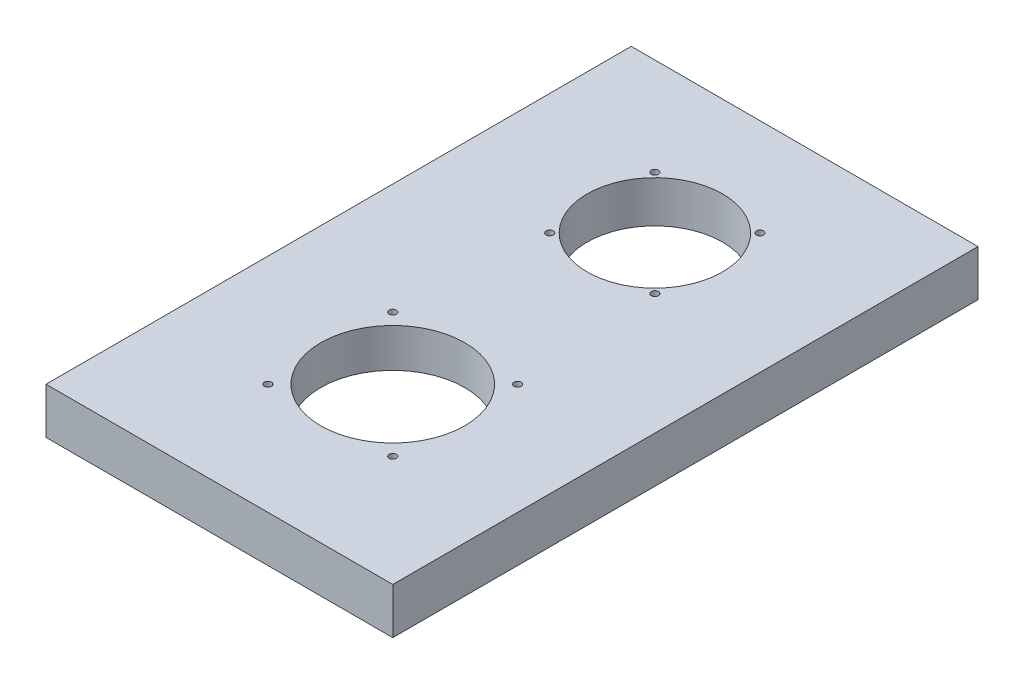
ISO-10303-21;
HEADER;
FILE_DESCRIPTION(('STEP AP214'),'2;1');
FILE_NAME('part.step','',(''),(''),'','','');
FILE_SCHEMA(('AUTOMOTIVE_DESIGN { 1 0 10303 214 1 1 1 1 }'));
ENDSEC;
DATA;
#1=APPLICATION_CONTEXT('core data for automotive mechanical design processes');
#2=APPLICATION_PROTOCOL_DEFINITION('international standard','automotive_design',2000,#1);
#3=PRODUCT_CONTEXT('',#1,'mechanical');
#4=PRODUCT('Part','Part','',(#3));
#5=PRODUCT_RELATED_PRODUCT_CATEGORY('part','',(#4));
#6=PRODUCT_DEFINITION_FORMATION('','',#4);
#7=PRODUCT_DEFINITION_CONTEXT('part definition',#1,'design');
#8=PRODUCT_DEFINITION('design','',#6,#7);
#9=PRODUCT_DEFINITION_SHAPE('','',#8);
#10=(LENGTH_UNIT() NAMED_UNIT(*) SI_UNIT(.MILLI.,.METRE.));
#11=(NAMED_UNIT(*) PLANE_ANGLE_UNIT() SI_UNIT($,.RADIAN.));
#12=(NAMED_UNIT(*) SI_UNIT($,.STERADIAN.) SOLID_ANGLE_UNIT());
#13=UNCERTAINTY_MEASURE_WITH_UNIT(LENGTH_MEASURE(1.E-05),#10,'distance_accuracy_value','');
#14=(GEOMETRIC_REPRESENTATION_CONTEXT(3) GLOBAL_UNCERTAINTY_ASSIGNED_CONTEXT((#13)) GLOBAL_UNIT_ASSIGNED_CONTEXT((#10,
#11,#12)) REPRESENTATION_CONTEXT('',''));
#15=CARTESIAN_POINT('',(0.,0.,0.));
#16=DIRECTION('',(0.,0.,1.));
#17=DIRECTION('',(1.,0.,0.));
#18=AXIS2_PLACEMENT_3D('',#15,#16,#17);
#19=CARTESIAN_POINT('',(0.,16.,41.4));
#20=DIRECTION('',(0.,-1.,0.));
#21=DIRECTION('',(0.,0.,-1.));
#22=AXIS2_PLACEMENT_3D('',#19,#20,#21);
#23=CYLINDRICAL_SURFACE('',#22,25.);
#24=CARTESIAN_POINT('',(0.,16.,41.4));
#25=DIRECTION('',(0.,-1.,0.));
#26=DIRECTION('',(0.,0.,-1.));
#27=AXIS2_PLACEMENT_3D('',#24,#25,#26);
#28=CIRCLE('',#27,25.);
#29=CARTESIAN_POINT('',(0.,16.,16.4));
#30=VERTEX_POINT('',#29);
#31=EDGE_CURVE('E144',#30,#30,#28,.T.);
#32=ORIENTED_EDGE('',*,*,#31,.F.);
#33=EDGE_LOOP('',(#32));
#34=FACE_BOUND('',#33,.T.);
#35=CARTESIAN_POINT('',(0.,2.5,41.4));
#36=DIRECTION('',(0.,-1.,0.));
#37=DIRECTION('',(0.,0.,-1.));
#38=AXIS2_PLACEMENT_3D('',#35,#36,#37);
#39=CIRCLE('',#38,25.);
#40=CARTESIAN_POINT('',(0.,2.5,16.4));
#41=VERTEX_POINT('',#40);
#42=EDGE_CURVE('E161',#41,#41,#39,.F.);
#43=ORIENTED_EDGE('',*,*,#42,.F.);
#44=EDGE_LOOP('',(#43));
#45=FACE_BOUND('',#44,.T.);
#46=ADVANCED_FACE('F32',(#34,#45),#23,.F.);
#47=CARTESIAN_POINT('',(-21.6728228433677,16.,63.0728228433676));
#48=DIRECTION('',(0.,-1.,0.));
#49=DIRECTION('',(0.,0.,-1.));
#50=AXIS2_PLACEMENT_3D('',#47,#48,#49);
#51=CYLINDRICAL_SURFACE('',#50,1.25);
#52=CARTESIAN_POINT('',(-21.6728228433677,16.,63.0728228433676));
#53=DIRECTION('',(0.,-1.,0.));
#54=DIRECTION('',(0.,0.,-1.));
#55=AXIS2_PLACEMENT_3D('',#52,#53,#54);
#56=CIRCLE('',#55,1.25);
#57=CARTESIAN_POINT('',(-21.6728228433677,16.,61.8228228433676));
#58=VERTEX_POINT('',#57);
#59=EDGE_CURVE('E149',#58,#58,#56,.T.);
#60=ORIENTED_EDGE('',*,*,#59,.F.);
#61=EDGE_LOOP('',(#60));
#62=FACE_BOUND('',#61,.T.);
#63=CARTESIAN_POINT('',(-21.6728228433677,2.5,63.0728228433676));
#64=DIRECTION('',(0.,-1.,0.));
#65=DIRECTION('',(0.,0.,-1.));
#66=AXIS2_PLACEMENT_3D('',#63,#64,#65);
#67=CIRCLE('',#66,1.25);
#68=CARTESIAN_POINT('',(-21.6728228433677,2.5,61.8228228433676));
#69=VERTEX_POINT('',#68);
#70=EDGE_CURVE('E164',#69,#69,#67,.F.);
#71=ORIENTED_EDGE('',*,*,#70,.F.);
#72=EDGE_LOOP('',(#71));
#73=FACE_BOUND('',#72,.T.);
#74=ADVANCED_FACE('F204',(#62,#73),#51,.F.);
#75=CARTESIAN_POINT('',(-21.6728228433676,16.,19.7271771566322));
#76=DIRECTION('',(0.,-1.,0.));
#77=DIRECTION('',(0.,0.,-1.));
#78=AXIS2_PLACEMENT_3D('',#75,#76,#77);
#79=CYLINDRICAL_SURFACE('',#78,1.25);
#80=CARTESIAN_POINT('',(-21.6728228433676,16.,19.7271771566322));
#81=DIRECTION('',(0.,-1.,0.));
#82=DIRECTION('',(0.,0.,-1.));
#83=AXIS2_PLACEMENT_3D('',#80,#81,#82);
#84=CIRCLE('',#83,1.25);
#85=CARTESIAN_POINT('',(-21.6728228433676,16.,18.4771771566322));
#86=VERTEX_POINT('',#85);
#87=EDGE_CURVE('E152',#86,#86,#84,.T.);
#88=ORIENTED_EDGE('',*,*,#87,.F.);
#89=EDGE_LOOP('',(#88));
#90=FACE_BOUND('',#89,.T.);
#91=CARTESIAN_POINT('',(-21.6728228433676,2.5,19.7271771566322));
#92=DIRECTION('',(0.,-1.,0.));
#93=DIRECTION('',(0.,0.,-1.));
#94=AXIS2_PLACEMENT_3D('',#91,#92,#93);
#95=CIRCLE('',#94,1.25);
#96=CARTESIAN_POINT('',(-21.6728228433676,2.5,18.4771771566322));
#97=VERTEX_POINT('',#96);
#98=EDGE_CURVE('E167',#97,#97,#95,.F.);
#99=ORIENTED_EDGE('',*,*,#98,.F.);
#100=EDGE_LOOP('',(#99));
#101=FACE_BOUND('',#100,.T.);
#102=ADVANCED_FACE('F198',(#90,#101),#79,.F.);
#103=CARTESIAN_POINT('',(21.6728228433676,16.,19.7271771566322));
#104=DIRECTION('',(0.,-1.,0.));
#105=DIRECTION('',(0.,0.,-1.));
#106=AXIS2_PLACEMENT_3D('',#103,#104,#105);
#107=CYLINDRICAL_SURFACE('',#106,1.25);
#108=CARTESIAN_POINT('',(21.6728228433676,16.,19.7271771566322));
#109=DIRECTION('',(0.,-1.,0.));
#110=DIRECTION('',(0.,0.,1.));
#111=AXIS2_PLACEMENT_3D('',#108,#109,#110);
#112=CIRCLE('',#111,1.25);
#113=CARTESIAN_POINT('',(21.6728228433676,16.,20.9771771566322));
#114=VERTEX_POINT('',#113);
#115=EDGE_CURVE('E155',#114,#114,#112,.T.);
#116=ORIENTED_EDGE('',*,*,#115,.F.);
#117=EDGE_LOOP('',(#116));
#118=FACE_BOUND('',#117,.T.);
#119=CARTESIAN_POINT('',(21.6728228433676,2.5,19.7271771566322));
#120=DIRECTION('',(0.,-1.,0.));
#121=DIRECTION('',(0.,0.,-1.));
#122=AXIS2_PLACEMENT_3D('',#119,#120,#121);
#123=CIRCLE('',#122,1.25);
#124=CARTESIAN_POINT('',(21.6728228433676,2.5,18.4771771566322));
#125=VERTEX_POINT('',#124);
#126=EDGE_CURVE('E170',#125,#125,#123,.F.);
#127=ORIENTED_EDGE('',*,*,#126,.F.);
#128=EDGE_LOOP('',(#127));
#129=FACE_BOUND('',#128,.T.);
#130=ADVANCED_FACE('F189',(#118,#129),#107,.F.);
#131=CARTESIAN_POINT('',(21.6728228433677,16.,63.0728228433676));
#132=DIRECTION('',(0.,-1.,0.));
#133=DIRECTION('',(0.,0.,-1.));
#134=AXIS2_PLACEMENT_3D('',#131,#132,#133);
#135=CYLINDRICAL_SURFACE('',#134,1.25);
#136=CARTESIAN_POINT('',(21.6728228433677,16.,63.0728228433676));
#137=DIRECTION('',(0.,-1.,0.));
#138=DIRECTION('',(0.,0.,1.));
#139=AXIS2_PLACEMENT_3D('',#136,#137,#138);
#140=CIRCLE('',#139,1.25);
#141=CARTESIAN_POINT('',(21.6728228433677,16.,64.3228228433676));
#142=VERTEX_POINT('',#141);
#143=EDGE_CURVE('E158',#142,#142,#140,.T.);
#144=ORIENTED_EDGE('',*,*,#143,.F.);
#145=EDGE_LOOP('',(#144));
#146=FACE_BOUND('',#145,.T.);
#147=CARTESIAN_POINT('',(21.6728228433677,2.5,63.0728228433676));
#148=DIRECTION('',(0.,-1.,0.));
#149=DIRECTION('',(0.,0.,-1.));
#150=AXIS2_PLACEMENT_3D('',#147,#148,#149);
#151=CIRCLE('',#150,1.25);
#152=CARTESIAN_POINT('',(21.6728228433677,2.5,61.8228228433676));
#153=VERTEX_POINT('',#152);
#154=EDGE_CURVE('E36',#153,#153,#151,.F.);
#155=ORIENTED_EDGE('',*,*,#154,.F.);
#156=EDGE_LOOP('',(#155));
#157=FACE_BOUND('',#156,.T.);
#158=ADVANCED_FACE('F186',(#146,#157),#135,.F.);
#159=CARTESIAN_POINT('',(0.,16.,-49.6));
#160=DIRECTION('',(0.,-1.,0.));
#161=DIRECTION('',(0.,0.,-1.));
#162=AXIS2_PLACEMENT_3D('',#159,#160,#161);
#163=CYLINDRICAL_SURFACE('',#162,23.5);
#164=CARTESIAN_POINT('',(0.,16.,-49.6));
#165=DIRECTION('',(0.,-1.,0.));
#166=DIRECTION('',(0.,0.,-1.));
#167=AXIS2_PLACEMENT_3D('',#164,#165,#166);
#168=CIRCLE('',#167,23.5);
#169=CARTESIAN_POINT('',(0.,16.,-73.1));
#170=VERTEX_POINT('',#169);
#171=EDGE_CURVE('E102',#170,#170,#168,.T.);
#172=ORIENTED_EDGE('',*,*,#171,.F.);
#173=EDGE_LOOP('',(#172));
#174=FACE_BOUND('',#173,.T.);
#175=CARTESIAN_POINT('',(0.,1.5,-49.6));
#176=DIRECTION('',(0.,-1.,0.));
#177=DIRECTION('',(0.,0.,-1.));
#178=AXIS2_PLACEMENT_3D('',#175,#176,#177);
#179=CIRCLE('',#178,23.5);
#180=CARTESIAN_POINT('',(0.,1.5,-73.1));
#181=VERTEX_POINT('',#180);
#182=EDGE_CURVE('E107',#181,#181,#179,.F.);
#183=ORIENTED_EDGE('',*,*,#182,.F.);
#184=EDGE_LOOP('',(#183));
#185=FACE_BOUND('',#184,.T.);
#186=ADVANCED_FACE('F188',(#174,#185),#163,.F.);
#187=CARTESIAN_POINT('',(60.2,16.,-101.6));
#188=DIRECTION('',(-1.,0.,0.));
#189=DIRECTION('',(0.,0.,1.));
#190=AXIS2_PLACEMENT_3D('',#187,#188,#189);
#191=PLANE('',#190);
#192=DIRECTION('',(0.,0.,-1.));
#193=VECTOR('',#192,1.);
#194=CARTESIAN_POINT('',(60.2,0.,-101.6));
#195=LINE('',#194,#193);
#196=CARTESIAN_POINT('',(60.2,0.,101.6));
#197=VERTEX_POINT('',#196);
#198=CARTESIAN_POINT('',(60.2,0.,-101.6));
#199=VERTEX_POINT('',#198);
#200=EDGE_CURVE('E99',#197,#199,#195,.T.);
#201=ORIENTED_EDGE('',*,*,#200,.T.);
#202=DIRECTION('',(0.,-1.,0.));
#203=VECTOR('',#202,1.);
#204=CARTESIAN_POINT('',(60.2,16.,-101.6));
#205=LINE('',#204,#203);
#206=CARTESIAN_POINT('',(60.2,16.,-101.6));
#207=VERTEX_POINT('',#206);
#208=EDGE_CURVE('E11',#207,#199,#205,.T.);
#209=ORIENTED_EDGE('',*,*,#208,.F.);
#210=DIRECTION('',(0.,0.,-1.));
#211=VECTOR('',#210,1.);
#212=CARTESIAN_POINT('',(60.2,16.,-101.6));
#213=LINE('',#212,#211);
#214=CARTESIAN_POINT('',(60.2,16.,101.6));
#215=VERTEX_POINT('',#214);
#216=EDGE_CURVE('E86',#215,#207,#213,.T.);
#217=ORIENTED_EDGE('',*,*,#216,.F.);
#218=DIRECTION('',(0.,-1.,0.));
#219=VECTOR('',#218,1.);
#220=CARTESIAN_POINT('',(60.2,16.,101.6));
#221=LINE('',#220,#219);
#222=EDGE_CURVE('E95',#215,#197,#221,.T.);
#223=ORIENTED_EDGE('',*,*,#222,.T.);
#224=EDGE_LOOP('',(#201,#209,#217,#223));
#225=FACE_BOUND('',#224,.T.);
#226=ADVANCED_FACE('F34',(#225),#191,.F.);
#227=CARTESIAN_POINT('',(-60.2,16.,-101.6));
#228=DIRECTION('',(0.,0.,1.));
#229=DIRECTION('',(1.,0.,0.));
#230=AXIS2_PLACEMENT_3D('',#227,#228,#229);
#231=PLANE('',#230);
#232=DIRECTION('',(-1.,0.,0.));
#233=VECTOR('',#232,1.);
#234=CARTESIAN_POINT('',(-60.2,0.,-101.6));
#235=LINE('',#234,#233);
#236=CARTESIAN_POINT('',(-60.2,0.,-101.6));
#237=VERTEX_POINT('',#236);
#238=EDGE_CURVE('E90',#199,#237,#235,.T.);
#239=ORIENTED_EDGE('',*,*,#238,.T.);
#240=DIRECTION('',(0.,-1.,0.));
#241=VECTOR('',#240,1.);
#242=CARTESIAN_POINT('',(-60.2,16.,-101.6));
#243=LINE('',#242,#241);
#244=CARTESIAN_POINT('',(-60.2,16.,-101.6));
#245=VERTEX_POINT('',#244);
#246=EDGE_CURVE('E42',#245,#237,#243,.T.);
#247=ORIENTED_EDGE('',*,*,#246,.F.);
#248=DIRECTION('',(-1.,0.,0.));
#249=VECTOR('',#248,1.);
#250=CARTESIAN_POINT('',(-60.2,16.,-101.6));
#251=LINE('',#250,#249);
#252=EDGE_CURVE('E81',#207,#245,#251,.T.);
#253=ORIENTED_EDGE('',*,*,#252,.F.);
#254=ORIENTED_EDGE('',*,*,#208,.T.);
#255=EDGE_LOOP('',(#239,#247,#253,#254));
#256=FACE_BOUND('',#255,.T.);
#257=ADVANCED_FACE('F89',(#256),#231,.F.);
#258=CARTESIAN_POINT('',(-60.2,16.,-101.6));
#259=DIRECTION('',(1.,0.,0.));
#260=DIRECTION('',(0.,0.,-1.));
#261=AXIS2_PLACEMENT_3D('',#258,#259,#260);
#262=PLANE('',#261);
#263=DIRECTION('',(0.,0.,1.));
#264=VECTOR('',#263,1.);
#265=CARTESIAN_POINT('',(-60.2,0.,-101.6));
#266=LINE('',#265,#264);
#267=CARTESIAN_POINT('',(-60.2,0.,101.6));
#268=VERTEX_POINT('',#267);
#269=EDGE_CURVE('E68',#237,#268,#266,.T.);
#270=ORIENTED_EDGE('',*,*,#269,.T.);
#271=DIRECTION('',(0.,-1.,0.));
#272=VECTOR('',#271,1.);
#273=CARTESIAN_POINT('',(-60.2,16.,101.6));
#274=LINE('',#273,#272);
#275=CARTESIAN_POINT('',(-60.2,16.,101.6));
#276=VERTEX_POINT('',#275);
#277=EDGE_CURVE('E91',#276,#268,#274,.T.);
#278=ORIENTED_EDGE('',*,*,#277,.F.);
#279=DIRECTION('',(0.,0.,1.));
#280=VECTOR('',#279,1.);
#281=CARTESIAN_POINT('',(-60.2,16.,-101.6));
#282=LINE('',#281,#280);
#283=EDGE_CURVE('E84',#245,#276,#282,.T.);
#284=ORIENTED_EDGE('',*,*,#283,.F.);
#285=ORIENTED_EDGE('',*,*,#246,.T.);
#286=EDGE_LOOP('',(#270,#278,#284,#285));
#287=FACE_BOUND('',#286,.T.);
#288=ADVANCED_FACE('F93',(#287),#262,.F.);
#289=CARTESIAN_POINT('',(-60.2,16.,101.6));
#290=DIRECTION('',(0.,0.,-1.));
#291=DIRECTION('',(-1.,0.,0.));
#292=AXIS2_PLACEMENT_3D('',#289,#290,#291);
#293=PLANE('',#292);
#294=DIRECTION('',(1.,0.,0.));
#295=VECTOR('',#294,1.);
#296=CARTESIAN_POINT('',(-60.2,0.,101.6));
#297=LINE('',#296,#295);
#298=EDGE_CURVE('E74',#268,#197,#297,.T.);
#299=ORIENTED_EDGE('',*,*,#298,.T.);
#300=ORIENTED_EDGE('',*,*,#222,.F.);
#301=DIRECTION('',(1.,0.,0.));
#302=VECTOR('',#301,1.);
#303=CARTESIAN_POINT('',(-60.2,16.,101.6));
#304=LINE('',#303,#302);
#305=EDGE_CURVE('E51',#276,#215,#304,.T.);
#306=ORIENTED_EDGE('',*,*,#305,.F.);
#307=ORIENTED_EDGE('',*,*,#277,.T.);
#308=EDGE_LOOP('',(#299,#300,#306,#307));
#309=FACE_BOUND('',#308,.T.);
#310=ADVANCED_FACE('F244',(#309),#293,.F.);
#311=CARTESIAN_POINT('',(60.2,16.,101.6));
#312=DIRECTION('',(0.,1.,0.));
#313=DIRECTION('',(0.,0.,1.));
#314=AXIS2_PLACEMENT_3D('',#311,#312,#313);
#315=PLANE('',#314);
#316=ORIENTED_EDGE('',*,*,#143,.T.);
#317=EDGE_LOOP('',(#316));
#318=FACE_BOUND('',#317,.T.);
#319=ORIENTED_EDGE('',*,*,#115,.T.);
#320=EDGE_LOOP('',(#319));
#321=FACE_BOUND('',#320,.T.);
#322=ORIENTED_EDGE('',*,*,#87,.T.);
#323=EDGE_LOOP('',(#322));
#324=FACE_BOUND('',#323,.T.);
#325=ORIENTED_EDGE('',*,*,#59,.T.);
#326=EDGE_LOOP('',(#325));
#327=FACE_BOUND('',#326,.T.);
#328=ORIENTED_EDGE('',*,*,#31,.T.);
#329=EDGE_LOOP('',(#328));
#330=FACE_BOUND('',#329,.T.);
#331=CARTESIAN_POINT('',(18.243354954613,16.,-31.3566450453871));
#332=DIRECTION('',(0.,-1.,0.));
#333=DIRECTION('',(0.,0.,1.));
#334=AXIS2_PLACEMENT_3D('',#331,#332,#333);
#335=CIRCLE('',#334,1.25);
#336=CARTESIAN_POINT('',(18.243354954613,16.,-32.6066450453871));
#337=VERTEX_POINT('',#336);
#338=EDGE_CURVE('E138',#337,#337,#335,.T.);
#339=ORIENTED_EDGE('',*,*,#338,.T.);
#340=EDGE_LOOP('',(#339));
#341=FACE_BOUND('',#340,.T.);
#342=CARTESIAN_POINT('',(18.2433549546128,16.,-67.843354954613));
#343=DIRECTION('',(0.,-1.,0.));
#344=DIRECTION('',(0.,0.,1.));
#345=AXIS2_PLACEMENT_3D('',#342,#343,#344);
#346=CIRCLE('',#345,1.25);
#347=CARTESIAN_POINT('',(18.2433549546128,16.,-69.093354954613));
#348=VERTEX_POINT('',#347);
#349=EDGE_CURVE('E132',#348,#348,#346,.T.);
#350=ORIENTED_EDGE('',*,*,#349,.T.);
#351=EDGE_LOOP('',(#350));
#352=FACE_BOUND('',#351,.T.);
#353=CARTESIAN_POINT('',(-18.2433549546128,16.,-67.843354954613));
#354=DIRECTION('',(0.,-1.,0.));
#355=DIRECTION('',(0.,0.,-1.));
#356=AXIS2_PLACEMENT_3D('',#353,#354,#355);
#357=CIRCLE('',#356,1.25000000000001);
#358=CARTESIAN_POINT('',(-18.2433549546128,16.,-69.093354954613));
#359=VERTEX_POINT('',#358);
#360=EDGE_CURVE('E126',#359,#359,#357,.T.);
#361=ORIENTED_EDGE('',*,*,#360,.T.);
#362=EDGE_LOOP('',(#361));
#363=FACE_BOUND('',#362,.T.);
#364=CARTESIAN_POINT('',(-18.243354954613,16.,-31.3566450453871));
#365=DIRECTION('',(0.,-1.,0.));
#366=DIRECTION('',(0.,0.,-1.));
#367=AXIS2_PLACEMENT_3D('',#364,#365,#366);
#368=CIRCLE('',#367,1.25);
#369=CARTESIAN_POINT('',(-18.243354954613,16.,-32.6066450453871));
#370=VERTEX_POINT('',#369);
#371=EDGE_CURVE('E120',#370,#370,#368,.T.);
#372=ORIENTED_EDGE('',*,*,#371,.T.);
#373=EDGE_LOOP('',(#372));
#374=FACE_BOUND('',#373,.T.);
#375=ORIENTED_EDGE('',*,*,#171,.T.);
#376=EDGE_LOOP('',(#375));
#377=FACE_BOUND('',#376,.T.);
#378=ORIENTED_EDGE('',*,*,#216,.T.);
#379=ORIENTED_EDGE('',*,*,#252,.T.);
#380=ORIENTED_EDGE('',*,*,#283,.T.);
#381=ORIENTED_EDGE('',*,*,#305,.T.);
#382=EDGE_LOOP('',(#378,#379,#380,#381));
#383=FACE_BOUND('',#382,.T.);
#384=ADVANCED_FACE('F82',(#318,#321,#324,#327,#330,#341,#352,#363,#374,#377,#383),#315,.T.);
#385=CARTESIAN_POINT('',(60.2,0.,101.6));
#386=DIRECTION('',(0.,1.,0.));
#387=DIRECTION('',(0.,0.,1.));
#388=AXIS2_PLACEMENT_3D('',#385,#386,#387);
#389=PLANE('',#388);
#390=CARTESIAN_POINT('',(0.,0.,41.4));
#391=DIRECTION('',(0.,-1.,0.));
#392=DIRECTION('',(0.,0.,-1.));
#393=AXIS2_PLACEMENT_3D('',#390,#391,#392);
#394=CIRCLE('',#393,38.);
#395=CARTESIAN_POINT('',(0.,0.,3.39999999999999));
#396=VERTEX_POINT('',#395);
#397=EDGE_CURVE('E173',#396,#396,#394,.T.);
#398=ORIENTED_EDGE('',*,*,#397,.F.);
#399=EDGE_LOOP('',(#398));
#400=FACE_BOUND('',#399,.T.);
#401=CARTESIAN_POINT('',(0.,0.,-49.6));
#402=DIRECTION('',(0.,-1.,0.));
#403=DIRECTION('',(0.,0.,-1.));
#404=AXIS2_PLACEMENT_3D('',#401,#402,#403);
#405=CIRCLE('',#404,33.);
#406=CARTESIAN_POINT('',(0.,0.,-82.6));
#407=VERTEX_POINT('',#406);
#408=EDGE_CURVE('E115',#407,#407,#405,.T.);
#409=ORIENTED_EDGE('',*,*,#408,.F.);
#410=EDGE_LOOP('',(#409));
#411=FACE_BOUND('',#410,.T.);
#412=ORIENTED_EDGE('',*,*,#200,.F.);
#413=ORIENTED_EDGE('',*,*,#298,.F.);
#414=ORIENTED_EDGE('',*,*,#269,.F.);
#415=ORIENTED_EDGE('',*,*,#238,.F.);
#416=EDGE_LOOP('',(#412,#413,#414,#415));
#417=FACE_BOUND('',#416,.T.);
#418=ADVANCED_FACE('F237',(#400,#411,#417),#389,.F.);
#419=CARTESIAN_POINT('',(0.,1.5,-49.6));
#420=DIRECTION('',(0.,-1.,0.));
#421=DIRECTION('',(0.,0.,-1.));
#422=AXIS2_PLACEMENT_3D('',#419,#420,#421);
#423=PLANE('',#422);
#424=CARTESIAN_POINT('',(18.243354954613,1.5,-31.3566450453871));
#425=DIRECTION('',(0.,-1.,0.));
#426=DIRECTION('',(0.,0.,1.));
#427=AXIS2_PLACEMENT_3D('',#424,#425,#426);
#428=CIRCLE('',#427,1.25);
#429=CARTESIAN_POINT('',(18.243354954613,1.5,-32.6066450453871));
#430=VERTEX_POINT('',#429);
#431=EDGE_CURVE('E141',#430,#430,#428,.T.);
#432=ORIENTED_EDGE('',*,*,#431,.F.);
#433=EDGE_LOOP('',(#432));
#434=FACE_BOUND('',#433,.T.);
#435=CARTESIAN_POINT('',(18.2433549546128,1.5,-67.843354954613));
#436=DIRECTION('',(0.,-1.,0.));
#437=DIRECTION('',(0.,0.,1.));
#438=AXIS2_PLACEMENT_3D('',#435,#436,#437);
#439=CIRCLE('',#438,1.25);
#440=CARTESIAN_POINT('',(18.2433549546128,1.5,-69.093354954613));
#441=VERTEX_POINT('',#440);
#442=EDGE_CURVE('E135',#441,#441,#439,.T.);
#443=ORIENTED_EDGE('',*,*,#442,.F.);
#444=EDGE_LOOP('',(#443));
#445=FACE_BOUND('',#444,.T.);
#446=CARTESIAN_POINT('',(-18.2433549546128,1.5,-67.843354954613));
#447=DIRECTION('',(0.,-1.,0.));
#448=DIRECTION('',(0.,0.,-1.));
#449=AXIS2_PLACEMENT_3D('',#446,#447,#448);
#450=CIRCLE('',#449,1.25000000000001);
#451=CARTESIAN_POINT('',(-18.2433549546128,1.5,-69.093354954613));
#452=VERTEX_POINT('',#451);
#453=EDGE_CURVE('E129',#452,#452,#450,.T.);
#454=ORIENTED_EDGE('',*,*,#453,.F.);
#455=EDGE_LOOP('',(#454));
#456=FACE_BOUND('',#455,.T.);
#457=CARTESIAN_POINT('',(-18.243354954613,1.5,-31.3566450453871));
#458=DIRECTION('',(0.,-1.,0.));
#459=DIRECTION('',(0.,0.,-1.));
#460=AXIS2_PLACEMENT_3D('',#457,#458,#459);
#461=CIRCLE('',#460,1.25);
#462=CARTESIAN_POINT('',(-18.243354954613,1.5,-32.6066450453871));
#463=VERTEX_POINT('',#462);
#464=EDGE_CURVE('E123',#463,#463,#461,.T.);
#465=ORIENTED_EDGE('',*,*,#464,.F.);
#466=EDGE_LOOP('',(#465));
#467=FACE_BOUND('',#466,.T.);
#468=CARTESIAN_POINT('',(0.,1.5,-49.6));
#469=DIRECTION('',(0.,-1.,0.));
#470=DIRECTION('',(0.,0.,-1.));
#471=AXIS2_PLACEMENT_3D('',#468,#469,#470);
#472=CIRCLE('',#471,33.);
#473=CARTESIAN_POINT('',(0.,1.5,-82.6));
#474=VERTEX_POINT('',#473);
#475=EDGE_CURVE('E109',#474,#474,#472,.T.);
#476=ORIENTED_EDGE('',*,*,#475,.T.);
#477=EDGE_LOOP('',(#476));
#478=FACE_BOUND('',#477,.T.);
#479=ORIENTED_EDGE('',*,*,#182,.T.);
#480=EDGE_LOOP('',(#479));
#481=FACE_BOUND('',#480,.T.);
#482=ADVANCED_FACE('F234',(#434,#445,#456,#467,#478,#481),#423,.T.);
#483=CARTESIAN_POINT('',(0.,1.5,-49.6));
#484=DIRECTION('',(0.,-1.,0.));
#485=DIRECTION('',(0.,0.,-1.));
#486=AXIS2_PLACEMENT_3D('',#483,#484,#485);
#487=CYLINDRICAL_SURFACE('',#486,33.);
#488=ORIENTED_EDGE('',*,*,#475,.F.);
#489=EDGE_LOOP('',(#488));
#490=FACE_BOUND('',#489,.T.);
#491=ORIENTED_EDGE('',*,*,#408,.T.);
#492=EDGE_LOOP('',(#491));
#493=FACE_BOUND('',#492,.T.);
#494=ADVANCED_FACE('F232',(#490,#493),#487,.F.);
#495=CARTESIAN_POINT('',(-18.243354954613,16.,-31.3566450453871));
#496=DIRECTION('',(0.,-1.,0.));
#497=DIRECTION('',(0.,0.,-1.));
#498=AXIS2_PLACEMENT_3D('',#495,#496,#497);
#499=CYLINDRICAL_SURFACE('',#498,1.25);
#500=CARTESIAN_POINT('',(-18.243354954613,16.,-32.6066450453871));
#501=CARTESIAN_POINT('',(-18.243354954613,15.8489583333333,-32.6066450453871));
#502=CARTESIAN_POINT('',(-18.243354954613,15.6979166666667,-32.6066450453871));
#503=CARTESIAN_POINT('',(-18.243354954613,15.3958333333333,-32.6066450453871));
#504=CARTESIAN_POINT('',(-18.243354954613,15.2447916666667,-32.6066450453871));
#505=CARTESIAN_POINT('',(-18.243354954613,14.9427083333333,-32.6066450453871));
#506=CARTESIAN_POINT('',(-18.243354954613,14.7916666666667,-32.6066450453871));
#507=CARTESIAN_POINT('',(-18.243354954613,14.4895833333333,-32.6066450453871));
#508=CARTESIAN_POINT('',(-18.243354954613,14.3385416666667,-32.6066450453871));
#509=CARTESIAN_POINT('',(-18.243354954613,14.0364583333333,-32.6066450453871));
#510=CARTESIAN_POINT('',(-18.243354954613,13.8854166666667,-32.6066450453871));
#511=CARTESIAN_POINT('',(-18.243354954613,13.5833333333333,-32.6066450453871));
#512=CARTESIAN_POINT('',(-18.243354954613,13.4322916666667,-32.6066450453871));
#513=CARTESIAN_POINT('',(-18.243354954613,13.1302083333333,-32.6066450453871));
#514=CARTESIAN_POINT('',(-18.243354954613,12.9791666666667,-32.6066450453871));
#515=CARTESIAN_POINT('',(-18.243354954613,12.6770833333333,-32.6066450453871));
#516=CARTESIAN_POINT('',(-18.243354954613,12.5260416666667,-32.6066450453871));
#517=CARTESIAN_POINT('',(-18.243354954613,12.2239583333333,-32.6066450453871));
#518=CARTESIAN_POINT('',(-18.243354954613,12.0729166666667,-32.6066450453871));
#519=CARTESIAN_POINT('',(-18.243354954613,11.7708333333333,-32.6066450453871));
#520=CARTESIAN_POINT('',(-18.243354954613,11.6197916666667,-32.6066450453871));
#521=CARTESIAN_POINT('',(-18.243354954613,11.3177083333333,-32.6066450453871));
#522=CARTESIAN_POINT('',(-18.243354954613,11.1666666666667,-32.6066450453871));
#523=CARTESIAN_POINT('',(-18.243354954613,10.8645833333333,-32.6066450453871));
#524=CARTESIAN_POINT('',(-18.243354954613,10.7135416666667,-32.6066450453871));
#525=CARTESIAN_POINT('',(-18.243354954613,10.4114583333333,-32.6066450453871));
#526=CARTESIAN_POINT('',(-18.243354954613,10.2604166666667,-32.6066450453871));
#527=CARTESIAN_POINT('',(-18.243354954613,9.95833333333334,-32.6066450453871));
#528=CARTESIAN_POINT('',(-18.243354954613,9.80729166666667,-32.6066450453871));
#529=CARTESIAN_POINT('',(-18.243354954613,9.50520833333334,-32.6066450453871));
#530=CARTESIAN_POINT('',(-18.243354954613,9.35416666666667,-32.6066450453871));
#531=CARTESIAN_POINT('',(-18.243354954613,9.05208333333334,-32.6066450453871));
#532=CARTESIAN_POINT('',(-18.243354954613,8.90104166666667,-32.6066450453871));
#533=CARTESIAN_POINT('',(-18.243354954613,8.59895833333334,-32.6066450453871));
#534=CARTESIAN_POINT('',(-18.243354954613,8.44791666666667,-32.6066450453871));
#535=CARTESIAN_POINT('',(-18.243354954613,8.14583333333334,-32.6066450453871));
#536=CARTESIAN_POINT('',(-18.243354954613,7.99479166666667,-32.6066450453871));
#537=CARTESIAN_POINT('',(-18.243354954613,7.69270833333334,-32.6066450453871));
#538=CARTESIAN_POINT('',(-18.243354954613,7.54166666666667,-32.6066450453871));
#539=CARTESIAN_POINT('',(-18.243354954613,7.23958333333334,-32.6066450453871));
#540=CARTESIAN_POINT('',(-18.243354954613,7.08854166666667,-32.6066450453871));
#541=CARTESIAN_POINT('',(-18.243354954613,6.78645833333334,-32.6066450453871));
#542=CARTESIAN_POINT('',(-18.243354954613,6.63541666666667,-32.6066450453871));
#543=CARTESIAN_POINT('',(-18.243354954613,6.33333333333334,-32.6066450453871));
#544=CARTESIAN_POINT('',(-18.243354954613,6.18229166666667,-32.6066450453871));
#545=CARTESIAN_POINT('',(-18.243354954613,5.88020833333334,-32.6066450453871));
#546=CARTESIAN_POINT('',(-18.243354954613,5.72916666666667,-32.6066450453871));
#547=CARTESIAN_POINT('',(-18.243354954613,5.42708333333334,-32.6066450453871));
#548=CARTESIAN_POINT('',(-18.243354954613,5.27604166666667,-32.6066450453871));
#549=CARTESIAN_POINT('',(-18.243354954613,4.97395833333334,-32.6066450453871));
#550=CARTESIAN_POINT('',(-18.243354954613,4.82291666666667,-32.6066450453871));
#551=CARTESIAN_POINT('',(-18.243354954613,4.52083333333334,-32.6066450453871));
#552=CARTESIAN_POINT('',(-18.243354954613,4.36979166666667,-32.6066450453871));
#553=CARTESIAN_POINT('',(-18.243354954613,4.06770833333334,-32.6066450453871));
#554=CARTESIAN_POINT('',(-18.243354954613,3.91666666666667,-32.6066450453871));
#555=CARTESIAN_POINT('',(-18.243354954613,3.61458333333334,-32.6066450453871));
#556=CARTESIAN_POINT('',(-18.243354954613,3.46354166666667,-32.6066450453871));
#557=CARTESIAN_POINT('',(-18.243354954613,3.16145833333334,-32.6066450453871));
#558=CARTESIAN_POINT('',(-18.243354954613,3.01041666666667,-32.6066450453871));
#559=CARTESIAN_POINT('',(-18.243354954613,2.70833333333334,-32.6066450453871));
#560=CARTESIAN_POINT('',(-18.243354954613,2.55729166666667,-32.6066450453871));
#561=CARTESIAN_POINT('',(-18.243354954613,2.25520833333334,-32.6066450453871));
#562=CARTESIAN_POINT('',(-18.243354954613,2.10416666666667,-32.6066450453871));
#563=CARTESIAN_POINT('',(-18.243354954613,1.80208333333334,-32.6066450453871));
#564=CARTESIAN_POINT('',(-18.243354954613,1.65104166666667,-32.6066450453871));
#565=CARTESIAN_POINT('',(-18.243354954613,1.5,-32.6066450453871));
#566=B_SPLINE_CURVE_WITH_KNOTS('',3,(#500,#501,#502,#503,#504,#505,#506,#507,#508,#509,#510,
#511,#512,#513,#514,#515,#516,#517,#518,#519,#520,#521,#522,#523,#524,#525,#526,#527,#528,#529,
#530,#531,#532,#533,#534,#535,#536,#537,#538,#539,#540,#541,#542,#543,#544,#545,#546,#547,#548,
#549,#550,#551,#552,#553,#554,#555,#556,#557,#558,#559,#560,#561,#562,#563,#564,#565),
.UNSPECIFIED.,.F.,.F.,(4,2,2,2,2,2,2,2,2,2,2,2,2,2,2,2,2,2,2,2,2,2,2,2,2,2,2,2,2,2,2,2,4),(0.,
0.453125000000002,0.906250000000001,1.359375,1.8125,2.265625,2.71875,3.171875,3.625,4.078125,
4.53125,4.984375,5.4375,5.890625,6.34375,6.796875,7.25,7.703125,8.15625,8.609375,9.0625,
9.515625,9.96875,10.421875,10.875,11.328125,11.78125,12.234375,12.6875,13.140625,13.59375,
14.046875,14.5),.UNSPECIFIED.);
#567=EDGE_CURVE('BSEAM228',#370,#463,#566,.T.);
#568=ORIENTED_EDGE('',*,*,#371,.F.);
#569=ORIENTED_EDGE('',*,*,#464,.T.);
#570=ORIENTED_EDGE('',*,*,#567,.T.);
#571=ORIENTED_EDGE('',*,*,#567,.F.);
#572=EDGE_LOOP('',(#568,#570,#569,#571));
#573=FACE_BOUND('',#572,.T.);
#574=ADVANCED_FACE('F228',(#573),#499,.F.);
#575=CARTESIAN_POINT('',(-18.2433549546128,16.,-67.843354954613));
#576=DIRECTION('',(0.,-1.,0.));
#577=DIRECTION('',(0.,0.,-1.));
#578=AXIS2_PLACEMENT_3D('',#575,#576,#577);
#579=CYLINDRICAL_SURFACE('',#578,1.25000000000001);
#580=CARTESIAN_POINT('',(-18.2433549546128,16.,-69.093354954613));
#581=CARTESIAN_POINT('',(-18.2433549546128,15.8489583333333,-69.093354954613));
#582=CARTESIAN_POINT('',(-18.2433549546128,15.6979166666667,-69.093354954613));
#583=CARTESIAN_POINT('',(-18.2433549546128,15.3958333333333,-69.093354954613));
#584=CARTESIAN_POINT('',(-18.2433549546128,15.2447916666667,-69.093354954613));
#585=CARTESIAN_POINT('',(-18.2433549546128,14.9427083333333,-69.093354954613));
#586=CARTESIAN_POINT('',(-18.2433549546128,14.7916666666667,-69.093354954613));
#587=CARTESIAN_POINT('',(-18.2433549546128,14.4895833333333,-69.093354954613));
#588=CARTESIAN_POINT('',(-18.2433549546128,14.3385416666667,-69.093354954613));
#589=CARTESIAN_POINT('',(-18.2433549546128,14.0364583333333,-69.093354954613));
#590=CARTESIAN_POINT('',(-18.2433549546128,13.8854166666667,-69.093354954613));
#591=CARTESIAN_POINT('',(-18.2433549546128,13.5833333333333,-69.093354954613));
#592=CARTESIAN_POINT('',(-18.2433549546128,13.4322916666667,-69.093354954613));
#593=CARTESIAN_POINT('',(-18.2433549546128,13.1302083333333,-69.093354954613));
#594=CARTESIAN_POINT('',(-18.2433549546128,12.9791666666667,-69.093354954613));
#595=CARTESIAN_POINT('',(-18.2433549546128,12.6770833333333,-69.093354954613));
#596=CARTESIAN_POINT('',(-18.2433549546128,12.5260416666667,-69.093354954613));
#597=CARTESIAN_POINT('',(-18.2433549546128,12.2239583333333,-69.093354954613));
#598=CARTESIAN_POINT('',(-18.2433549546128,12.0729166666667,-69.093354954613));
#599=CARTESIAN_POINT('',(-18.2433549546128,11.7708333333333,-69.093354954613));
#600=CARTESIAN_POINT('',(-18.2433549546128,11.6197916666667,-69.093354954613));
#601=CARTESIAN_POINT('',(-18.2433549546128,11.3177083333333,-69.093354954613));
#602=CARTESIAN_POINT('',(-18.2433549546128,11.1666666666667,-69.093354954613));
#603=CARTESIAN_POINT('',(-18.2433549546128,10.8645833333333,-69.093354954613));
#604=CARTESIAN_POINT('',(-18.2433549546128,10.7135416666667,-69.093354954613));
#605=CARTESIAN_POINT('',(-18.2433549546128,10.4114583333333,-69.093354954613));
#606=CARTESIAN_POINT('',(-18.2433549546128,10.2604166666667,-69.093354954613));
#607=CARTESIAN_POINT('',(-18.2433549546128,9.95833333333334,-69.093354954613));
#608=CARTESIAN_POINT('',(-18.2433549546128,9.80729166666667,-69.093354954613));
#609=CARTESIAN_POINT('',(-18.2433549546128,9.50520833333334,-69.093354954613));
#610=CARTESIAN_POINT('',(-18.2433549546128,9.35416666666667,-69.093354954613));
#611=CARTESIAN_POINT('',(-18.2433549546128,9.05208333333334,-69.093354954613));
#612=CARTESIAN_POINT('',(-18.2433549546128,8.90104166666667,-69.093354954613));
#613=CARTESIAN_POINT('',(-18.2433549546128,8.59895833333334,-69.093354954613));
#614=CARTESIAN_POINT('',(-18.2433549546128,8.44791666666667,-69.093354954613));
#615=CARTESIAN_POINT('',(-18.2433549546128,8.14583333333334,-69.093354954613));
#616=CARTESIAN_POINT('',(-18.2433549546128,7.99479166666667,-69.093354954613));
#617=CARTESIAN_POINT('',(-18.2433549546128,7.69270833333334,-69.093354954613));
#618=CARTESIAN_POINT('',(-18.2433549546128,7.54166666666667,-69.093354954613));
#619=CARTESIAN_POINT('',(-18.2433549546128,7.23958333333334,-69.093354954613));
#620=CARTESIAN_POINT('',(-18.2433549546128,7.08854166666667,-69.093354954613));
#621=CARTESIAN_POINT('',(-18.2433549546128,6.78645833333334,-69.093354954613));
#622=CARTESIAN_POINT('',(-18.2433549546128,6.63541666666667,-69.093354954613));
#623=CARTESIAN_POINT('',(-18.2433549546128,6.33333333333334,-69.093354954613));
#624=CARTESIAN_POINT('',(-18.2433549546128,6.18229166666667,-69.093354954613));
#625=CARTESIAN_POINT('',(-18.2433549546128,5.88020833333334,-69.093354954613));
#626=CARTESIAN_POINT('',(-18.2433549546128,5.72916666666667,-69.093354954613));
#627=CARTESIAN_POINT('',(-18.2433549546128,5.42708333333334,-69.093354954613));
#628=CARTESIAN_POINT('',(-18.2433549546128,5.27604166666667,-69.093354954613));
#629=CARTESIAN_POINT('',(-18.2433549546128,4.97395833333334,-69.093354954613));
#630=CARTESIAN_POINT('',(-18.2433549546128,4.82291666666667,-69.093354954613));
#631=CARTESIAN_POINT('',(-18.2433549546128,4.52083333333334,-69.093354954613));
#632=CARTESIAN_POINT('',(-18.2433549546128,4.36979166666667,-69.093354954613));
#633=CARTESIAN_POINT('',(-18.2433549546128,4.06770833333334,-69.093354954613));
#634=CARTESIAN_POINT('',(-18.2433549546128,3.91666666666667,-69.093354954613));
#635=CARTESIAN_POINT('',(-18.2433549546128,3.61458333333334,-69.093354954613));
#636=CARTESIAN_POINT('',(-18.2433549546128,3.46354166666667,-69.093354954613));
#637=CARTESIAN_POINT('',(-18.2433549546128,3.16145833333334,-69.093354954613));
#638=CARTESIAN_POINT('',(-18.2433549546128,3.01041666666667,-69.093354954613));
#639=CARTESIAN_POINT('',(-18.2433549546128,2.70833333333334,-69.093354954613));
#640=CARTESIAN_POINT('',(-18.2433549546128,2.55729166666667,-69.093354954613));
#641=CARTESIAN_POINT('',(-18.2433549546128,2.25520833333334,-69.093354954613));
#642=CARTESIAN_POINT('',(-18.2433549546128,2.10416666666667,-69.093354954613));
#643=CARTESIAN_POINT('',(-18.2433549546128,1.80208333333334,-69.093354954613));
#644=CARTESIAN_POINT('',(-18.2433549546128,1.65104166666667,-69.093354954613));
#645=CARTESIAN_POINT('',(-18.2433549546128,1.5,-69.093354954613));
#646=B_SPLINE_CURVE_WITH_KNOTS('',3,(#580,#581,#582,#583,#584,#585,#586,#587,#588,#589,#590,
#591,#592,#593,#594,#595,#596,#597,#598,#599,#600,#601,#602,#603,#604,#605,#606,#607,#608,#609,
#610,#611,#612,#613,#614,#615,#616,#617,#618,#619,#620,#621,#622,#623,#624,#625,#626,#627,#628,
#629,#630,#631,#632,#633,#634,#635,#636,#637,#638,#639,#640,#641,#642,#643,#644,#645),
.UNSPECIFIED.,.F.,.F.,(4,2,2,2,2,2,2,2,2,2,2,2,2,2,2,2,2,2,2,2,2,2,2,2,2,2,2,2,2,2,2,2,4),(0.,
0.453125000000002,0.906250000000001,1.359375,1.8125,2.265625,2.71875,3.171875,3.625,4.078125,
4.53125,4.984375,5.4375,5.890625,6.34375,6.796875,7.25,7.703125,8.15625,8.609375,9.0625,
9.515625,9.96875,10.421875,10.875,11.328125,11.78125,12.234375,12.6875,13.140625,13.59375,
14.046875,14.5),.UNSPECIFIED.);
#647=EDGE_CURVE('BSEAM224',#359,#452,#646,.T.);
#648=ORIENTED_EDGE('',*,*,#360,.F.);
#649=ORIENTED_EDGE('',*,*,#453,.T.);
#650=ORIENTED_EDGE('',*,*,#647,.T.);
#651=ORIENTED_EDGE('',*,*,#647,.F.);
#652=EDGE_LOOP('',(#648,#650,#649,#651));
#653=FACE_BOUND('',#652,.T.);
#654=ADVANCED_FACE('F224',(#653),#579,.F.);
#655=CARTESIAN_POINT('',(18.2433549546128,16.,-67.843354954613));
#656=DIRECTION('',(0.,-1.,0.));
#657=DIRECTION('',(0.,0.,-1.));
#658=AXIS2_PLACEMENT_3D('',#655,#656,#657);
#659=CYLINDRICAL_SURFACE('',#658,1.25);
#660=CARTESIAN_POINT('',(18.2433549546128,16.,-69.093354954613));
#661=CARTESIAN_POINT('',(18.2433549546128,15.8489583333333,-69.093354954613));
#662=CARTESIAN_POINT('',(18.2433549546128,15.6979166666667,-69.093354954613));
#663=CARTESIAN_POINT('',(18.2433549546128,15.3958333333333,-69.093354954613));
#664=CARTESIAN_POINT('',(18.2433549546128,15.2447916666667,-69.093354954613));
#665=CARTESIAN_POINT('',(18.2433549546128,14.9427083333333,-69.093354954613));
#666=CARTESIAN_POINT('',(18.2433549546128,14.7916666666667,-69.093354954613));
#667=CARTESIAN_POINT('',(18.2433549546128,14.4895833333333,-69.093354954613));
#668=CARTESIAN_POINT('',(18.2433549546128,14.3385416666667,-69.093354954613));
#669=CARTESIAN_POINT('',(18.2433549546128,14.0364583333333,-69.093354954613));
#670=CARTESIAN_POINT('',(18.2433549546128,13.8854166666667,-69.093354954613));
#671=CARTESIAN_POINT('',(18.2433549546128,13.5833333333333,-69.093354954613));
#672=CARTESIAN_POINT('',(18.2433549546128,13.4322916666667,-69.093354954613));
#673=CARTESIAN_POINT('',(18.2433549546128,13.1302083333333,-69.093354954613));
#674=CARTESIAN_POINT('',(18.2433549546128,12.9791666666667,-69.093354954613));
#675=CARTESIAN_POINT('',(18.2433549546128,12.6770833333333,-69.093354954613));
#676=CARTESIAN_POINT('',(18.2433549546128,12.5260416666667,-69.093354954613));
#677=CARTESIAN_POINT('',(18.2433549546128,12.2239583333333,-69.093354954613));
#678=CARTESIAN_POINT('',(18.2433549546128,12.0729166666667,-69.093354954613));
#679=CARTESIAN_POINT('',(18.2433549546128,11.7708333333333,-69.093354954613));
#680=CARTESIAN_POINT('',(18.2433549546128,11.6197916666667,-69.093354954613));
#681=CARTESIAN_POINT('',(18.2433549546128,11.3177083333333,-69.093354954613));
#682=CARTESIAN_POINT('',(18.2433549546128,11.1666666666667,-69.093354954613));
#683=CARTESIAN_POINT('',(18.2433549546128,10.8645833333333,-69.093354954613));
#684=CARTESIAN_POINT('',(18.2433549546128,10.7135416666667,-69.093354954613));
#685=CARTESIAN_POINT('',(18.2433549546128,10.4114583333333,-69.093354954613));
#686=CARTESIAN_POINT('',(18.2433549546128,10.2604166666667,-69.093354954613));
#687=CARTESIAN_POINT('',(18.2433549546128,9.95833333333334,-69.093354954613));
#688=CARTESIAN_POINT('',(18.2433549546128,9.80729166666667,-69.093354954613));
#689=CARTESIAN_POINT('',(18.2433549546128,9.50520833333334,-69.093354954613));
#690=CARTESIAN_POINT('',(18.2433549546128,9.35416666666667,-69.093354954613));
#691=CARTESIAN_POINT('',(18.2433549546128,9.05208333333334,-69.093354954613));
#692=CARTESIAN_POINT('',(18.2433549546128,8.90104166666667,-69.093354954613));
#693=CARTESIAN_POINT('',(18.2433549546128,8.59895833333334,-69.093354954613));
#694=CARTESIAN_POINT('',(18.2433549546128,8.44791666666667,-69.093354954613));
#695=CARTESIAN_POINT('',(18.2433549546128,8.14583333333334,-69.093354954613));
#696=CARTESIAN_POINT('',(18.2433549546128,7.99479166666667,-69.093354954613));
#697=CARTESIAN_POINT('',(18.2433549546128,7.69270833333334,-69.093354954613));
#698=CARTESIAN_POINT('',(18.2433549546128,7.54166666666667,-69.093354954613));
#699=CARTESIAN_POINT('',(18.2433549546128,7.23958333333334,-69.093354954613));
#700=CARTESIAN_POINT('',(18.2433549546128,7.08854166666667,-69.093354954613));
#701=CARTESIAN_POINT('',(18.2433549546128,6.78645833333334,-69.093354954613));
#702=CARTESIAN_POINT('',(18.2433549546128,6.63541666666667,-69.093354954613));
#703=CARTESIAN_POINT('',(18.2433549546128,6.33333333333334,-69.093354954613));
#704=CARTESIAN_POINT('',(18.2433549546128,6.18229166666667,-69.093354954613));
#705=CARTESIAN_POINT('',(18.2433549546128,5.88020833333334,-69.093354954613));
#706=CARTESIAN_POINT('',(18.2433549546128,5.72916666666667,-69.093354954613));
#707=CARTESIAN_POINT('',(18.2433549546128,5.42708333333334,-69.093354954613));
#708=CARTESIAN_POINT('',(18.2433549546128,5.27604166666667,-69.093354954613));
#709=CARTESIAN_POINT('',(18.2433549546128,4.97395833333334,-69.093354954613));
#710=CARTESIAN_POINT('',(18.2433549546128,4.82291666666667,-69.093354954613));
#711=CARTESIAN_POINT('',(18.2433549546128,4.52083333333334,-69.093354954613));
#712=CARTESIAN_POINT('',(18.2433549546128,4.36979166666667,-69.093354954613));
#713=CARTESIAN_POINT('',(18.2433549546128,4.06770833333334,-69.093354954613));
#714=CARTESIAN_POINT('',(18.2433549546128,3.91666666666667,-69.093354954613));
#715=CARTESIAN_POINT('',(18.2433549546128,3.61458333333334,-69.093354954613));
#716=CARTESIAN_POINT('',(18.2433549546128,3.46354166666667,-69.093354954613));
#717=CARTESIAN_POINT('',(18.2433549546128,3.16145833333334,-69.093354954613));
#718=CARTESIAN_POINT('',(18.2433549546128,3.01041666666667,-69.093354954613));
#719=CARTESIAN_POINT('',(18.2433549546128,2.70833333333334,-69.093354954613));
#720=CARTESIAN_POINT('',(18.2433549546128,2.55729166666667,-69.093354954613));
#721=CARTESIAN_POINT('',(18.2433549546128,2.25520833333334,-69.093354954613));
#722=CARTESIAN_POINT('',(18.2433549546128,2.10416666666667,-69.093354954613));
#723=CARTESIAN_POINT('',(18.2433549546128,1.80208333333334,-69.093354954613));
#724=CARTESIAN_POINT('',(18.2433549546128,1.65104166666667,-69.093354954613));
#725=CARTESIAN_POINT('',(18.2433549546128,1.5,-69.093354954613));
#726=B_SPLINE_CURVE_WITH_KNOTS('',3,(#660,#661,#662,#663,#664,#665,#666,#667,#668,#669,#670,
#671,#672,#673,#674,#675,#676,#677,#678,#679,#680,#681,#682,#683,#684,#685,#686,#687,#688,#689,
#690,#691,#692,#693,#694,#695,#696,#697,#698,#699,#700,#701,#702,#703,#704,#705,#706,#707,#708,
#709,#710,#711,#712,#713,#714,#715,#716,#717,#718,#719,#720,#721,#722,#723,#724,#725),
.UNSPECIFIED.,.F.,.F.,(4,2,2,2,2,2,2,2,2,2,2,2,2,2,2,2,2,2,2,2,2,2,2,2,2,2,2,2,2,2,2,2,4),(0.,
0.453125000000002,0.906250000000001,1.359375,1.8125,2.265625,2.71875,3.171875,3.625,4.078125,
4.53125,4.984375,5.4375,5.890625,6.34375,6.796875,7.25,7.703125,8.15625,8.609375,9.0625,
9.515625,9.96875,10.421875,10.875,11.328125,11.78125,12.234375,12.6875,13.140625,13.59375,
14.046875,14.5),.UNSPECIFIED.);
#727=EDGE_CURVE('BSEAM220',#348,#441,#726,.T.);
#728=ORIENTED_EDGE('',*,*,#349,.F.);
#729=ORIENTED_EDGE('',*,*,#442,.T.);
#730=ORIENTED_EDGE('',*,*,#727,.T.);
#731=ORIENTED_EDGE('',*,*,#727,.F.);
#732=EDGE_LOOP('',(#728,#730,#729,#731));
#733=FACE_BOUND('',#732,.T.);
#734=ADVANCED_FACE('F220',(#733),#659,.F.);
#735=CARTESIAN_POINT('',(18.243354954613,16.,-31.3566450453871));
#736=DIRECTION('',(0.,-1.,0.));
#737=DIRECTION('',(0.,0.,-1.));
#738=AXIS2_PLACEMENT_3D('',#735,#736,#737);
#739=CYLINDRICAL_SURFACE('',#738,1.25);
#740=CARTESIAN_POINT('',(18.243354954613,16.,-32.6066450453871));
#741=CARTESIAN_POINT('',(18.243354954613,15.8489583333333,-32.6066450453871));
#742=CARTESIAN_POINT('',(18.243354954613,15.6979166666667,-32.6066450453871));
#743=CARTESIAN_POINT('',(18.243354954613,15.3958333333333,-32.6066450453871));
#744=CARTESIAN_POINT('',(18.243354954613,15.2447916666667,-32.6066450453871));
#745=CARTESIAN_POINT('',(18.243354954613,14.9427083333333,-32.6066450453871));
#746=CARTESIAN_POINT('',(18.243354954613,14.7916666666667,-32.6066450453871));
#747=CARTESIAN_POINT('',(18.243354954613,14.4895833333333,-32.6066450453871));
#748=CARTESIAN_POINT('',(18.243354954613,14.3385416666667,-32.6066450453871));
#749=CARTESIAN_POINT('',(18.243354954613,14.0364583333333,-32.6066450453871));
#750=CARTESIAN_POINT('',(18.243354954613,13.8854166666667,-32.6066450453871));
#751=CARTESIAN_POINT('',(18.243354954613,13.5833333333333,-32.6066450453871));
#752=CARTESIAN_POINT('',(18.243354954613,13.4322916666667,-32.6066450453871));
#753=CARTESIAN_POINT('',(18.243354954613,13.1302083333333,-32.6066450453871));
#754=CARTESIAN_POINT('',(18.243354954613,12.9791666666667,-32.6066450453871));
#755=CARTESIAN_POINT('',(18.243354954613,12.6770833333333,-32.6066450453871));
#756=CARTESIAN_POINT('',(18.243354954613,12.5260416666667,-32.6066450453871));
#757=CARTESIAN_POINT('',(18.243354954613,12.2239583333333,-32.6066450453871));
#758=CARTESIAN_POINT('',(18.243354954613,12.0729166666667,-32.6066450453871));
#759=CARTESIAN_POINT('',(18.243354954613,11.7708333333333,-32.6066450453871));
#760=CARTESIAN_POINT('',(18.243354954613,11.6197916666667,-32.6066450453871));
#761=CARTESIAN_POINT('',(18.243354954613,11.3177083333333,-32.6066450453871));
#762=CARTESIAN_POINT('',(18.243354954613,11.1666666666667,-32.6066450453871));
#763=CARTESIAN_POINT('',(18.243354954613,10.8645833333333,-32.6066450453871));
#764=CARTESIAN_POINT('',(18.243354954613,10.7135416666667,-32.6066450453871));
#765=CARTESIAN_POINT('',(18.243354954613,10.4114583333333,-32.6066450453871));
#766=CARTESIAN_POINT('',(18.243354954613,10.2604166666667,-32.6066450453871));
#767=CARTESIAN_POINT('',(18.243354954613,9.95833333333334,-32.6066450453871));
#768=CARTESIAN_POINT('',(18.243354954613,9.80729166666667,-32.6066450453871));
#769=CARTESIAN_POINT('',(18.243354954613,9.50520833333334,-32.6066450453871));
#770=CARTESIAN_POINT('',(18.243354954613,9.35416666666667,-32.6066450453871));
#771=CARTESIAN_POINT('',(18.243354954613,9.05208333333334,-32.6066450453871));
#772=CARTESIAN_POINT('',(18.243354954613,8.90104166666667,-32.6066450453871));
#773=CARTESIAN_POINT('',(18.243354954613,8.59895833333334,-32.6066450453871));
#774=CARTESIAN_POINT('',(18.243354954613,8.44791666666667,-32.6066450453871));
#775=CARTESIAN_POINT('',(18.243354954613,8.14583333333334,-32.6066450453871));
#776=CARTESIAN_POINT('',(18.243354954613,7.99479166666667,-32.6066450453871));
#777=CARTESIAN_POINT('',(18.243354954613,7.69270833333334,-32.6066450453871));
#778=CARTESIAN_POINT('',(18.243354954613,7.54166666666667,-32.6066450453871));
#779=CARTESIAN_POINT('',(18.243354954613,7.23958333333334,-32.6066450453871));
#780=CARTESIAN_POINT('',(18.243354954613,7.08854166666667,-32.6066450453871));
#781=CARTESIAN_POINT('',(18.243354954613,6.78645833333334,-32.6066450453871));
#782=CARTESIAN_POINT('',(18.243354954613,6.63541666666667,-32.6066450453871));
#783=CARTESIAN_POINT('',(18.243354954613,6.33333333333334,-32.6066450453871));
#784=CARTESIAN_POINT('',(18.243354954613,6.18229166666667,-32.6066450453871));
#785=CARTESIAN_POINT('',(18.243354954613,5.88020833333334,-32.6066450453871));
#786=CARTESIAN_POINT('',(18.243354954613,5.72916666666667,-32.6066450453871));
#787=CARTESIAN_POINT('',(18.243354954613,5.42708333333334,-32.6066450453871));
#788=CARTESIAN_POINT('',(18.243354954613,5.27604166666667,-32.6066450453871));
#789=CARTESIAN_POINT('',(18.243354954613,4.97395833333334,-32.6066450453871));
#790=CARTESIAN_POINT('',(18.243354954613,4.82291666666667,-32.6066450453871));
#791=CARTESIAN_POINT('',(18.243354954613,4.52083333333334,-32.6066450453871));
#792=CARTESIAN_POINT('',(18.243354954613,4.36979166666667,-32.6066450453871));
#793=CARTESIAN_POINT('',(18.243354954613,4.06770833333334,-32.6066450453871));
#794=CARTESIAN_POINT('',(18.243354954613,3.91666666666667,-32.6066450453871));
#795=CARTESIAN_POINT('',(18.243354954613,3.61458333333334,-32.6066450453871));
#796=CARTESIAN_POINT('',(18.243354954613,3.46354166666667,-32.6066450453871));
#797=CARTESIAN_POINT('',(18.243354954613,3.16145833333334,-32.6066450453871));
#798=CARTESIAN_POINT('',(18.243354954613,3.01041666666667,-32.6066450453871));
#799=CARTESIAN_POINT('',(18.243354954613,2.70833333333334,-32.6066450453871));
#800=CARTESIAN_POINT('',(18.243354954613,2.55729166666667,-32.6066450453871));
#801=CARTESIAN_POINT('',(18.243354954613,2.25520833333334,-32.6066450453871));
#802=CARTESIAN_POINT('',(18.243354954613,2.10416666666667,-32.6066450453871));
#803=CARTESIAN_POINT('',(18.243354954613,1.80208333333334,-32.6066450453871));
#804=CARTESIAN_POINT('',(18.243354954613,1.65104166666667,-32.6066450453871));
#805=CARTESIAN_POINT('',(18.243354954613,1.5,-32.6066450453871));
#806=B_SPLINE_CURVE_WITH_KNOTS('',3,(#740,#741,#742,#743,#744,#745,#746,#747,#748,#749,#750,
#751,#752,#753,#754,#755,#756,#757,#758,#759,#760,#761,#762,#763,#764,#765,#766,#767,#768,#769,
#770,#771,#772,#773,#774,#775,#776,#777,#778,#779,#780,#781,#782,#783,#784,#785,#786,#787,#788,
#789,#790,#791,#792,#793,#794,#795,#796,#797,#798,#799,#800,#801,#802,#803,#804,#805),
.UNSPECIFIED.,.F.,.F.,(4,2,2,2,2,2,2,2,2,2,2,2,2,2,2,2,2,2,2,2,2,2,2,2,2,2,2,2,2,2,2,2,4),(0.,
0.453125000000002,0.906250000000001,1.359375,1.8125,2.265625,2.71875,3.171875,3.625,4.078125,
4.53125,4.984375,5.4375,5.890625,6.34375,6.796875,7.25,7.703125,8.15625,8.609375,9.0625,
9.515625,9.96875,10.421875,10.875,11.328125,11.78125,12.234375,12.6875,13.140625,13.59375,
14.046875,14.5),.UNSPECIFIED.);
#807=EDGE_CURVE('BSEAM217',#337,#430,#806,.T.);
#808=ORIENTED_EDGE('',*,*,#338,.F.);
#809=ORIENTED_EDGE('',*,*,#431,.T.);
#810=ORIENTED_EDGE('',*,*,#807,.T.);
#811=ORIENTED_EDGE('',*,*,#807,.F.);
#812=EDGE_LOOP('',(#808,#810,#809,#811));
#813=FACE_BOUND('',#812,.T.);
#814=ADVANCED_FACE('F217',(#813),#739,.F.);
#815=CARTESIAN_POINT('',(0.,2.5,41.4));
#816=DIRECTION('',(0.,-1.,0.));
#817=DIRECTION('',(0.,0.,-1.));
#818=AXIS2_PLACEMENT_3D('',#815,#816,#817);
#819=PLANE('',#818);
#820=ORIENTED_EDGE('',*,*,#70,.T.);
#821=EDGE_LOOP('',(#820));
#822=FACE_BOUND('',#821,.T.);
#823=ORIENTED_EDGE('',*,*,#126,.T.);
#824=EDGE_LOOP('',(#823));
#825=FACE_BOUND('',#824,.T.);
#826=CARTESIAN_POINT('',(0.,2.5,41.4));
#827=DIRECTION('',(0.,-1.,0.));
#828=DIRECTION('',(0.,0.,-1.));
#829=AXIS2_PLACEMENT_3D('',#826,#827,#828);
#830=CIRCLE('',#829,38.);
#831=CARTESIAN_POINT('',(0.,2.5,3.39999999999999));
#832=VERTEX_POINT('',#831);
#833=EDGE_CURVE('E176',#832,#832,#830,.T.);
#834=ORIENTED_EDGE('',*,*,#833,.T.);
#835=EDGE_LOOP('',(#834));
#836=FACE_BOUND('',#835,.T.);
#837=ORIENTED_EDGE('',*,*,#154,.T.);
#838=EDGE_LOOP('',(#837));
#839=FACE_BOUND('',#838,.T.);
#840=ORIENTED_EDGE('',*,*,#98,.T.);
#841=EDGE_LOOP('',(#840));
#842=FACE_BOUND('',#841,.T.);
#843=ORIENTED_EDGE('',*,*,#42,.T.);
#844=EDGE_LOOP('',(#843));
#845=FACE_BOUND('',#844,.T.);
#846=ADVANCED_FACE('F183',(#822,#825,#836,#839,#842,#845),#819,.T.);
#847=CARTESIAN_POINT('',(0.,2.5,41.4));
#848=DIRECTION('',(0.,-1.,0.));
#849=DIRECTION('',(0.,0.,-1.));
#850=AXIS2_PLACEMENT_3D('',#847,#848,#849);
#851=CYLINDRICAL_SURFACE('',#850,38.);
#852=ORIENTED_EDGE('',*,*,#833,.F.);
#853=EDGE_LOOP('',(#852));
#854=FACE_BOUND('',#853,.T.);
#855=ORIENTED_EDGE('',*,*,#397,.T.);
#856=EDGE_LOOP('',(#855));
#857=FACE_BOUND('',#856,.T.);
#858=ADVANCED_FACE('F331',(#854,#857),#851,.F.);
#859=CLOSED_SHELL('',(#46,#74,#102,#130,#158,#186,#226,#257,#288,#310,#384,#418,#482,#494,#574,
#654,#734,#814,#846,#858));
#860=MANIFOLD_SOLID_BREP('B2',#859);
#861=ADVANCED_BREP_SHAPE_REPRESENTATION('',(#18,#860),#14);
#862=SHAPE_DEFINITION_REPRESENTATION(#9,#861);
ENDSEC;
END-ISO-10303-21;
